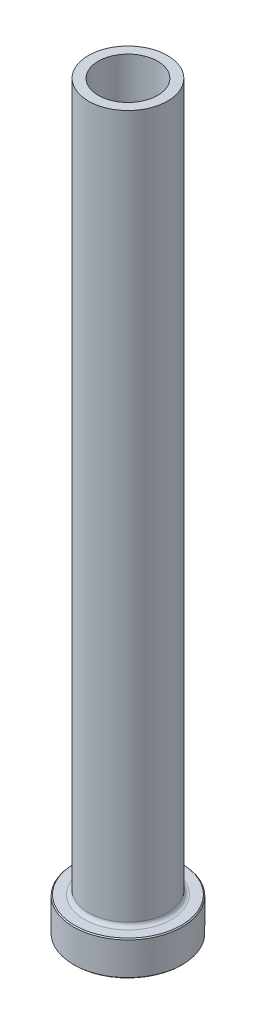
from build123d import *

# Parameters (mm, degrees)
FILLET1_R     = 0.8
CHAMFER1_SIZE = 0.2
CHAMFER3_SIZE = 0.5


with BuildPart() as part:
    # Sketch1 → Revolve1 (revolve)
    with BuildSketch(Plane.XY, mode=Mode.PRIVATE) as revolve1_sk:
        Polygon((-6, 150), (-8, 150), (-8, 7), (-11, 7), (-11, 0), (-6.25, 0), (-6.25, 83), (-6, 95), align=None)
    revolve(revolve1_sk.sketch.rotate(Axis((0, 92.187680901, 0), (0, -1, 0)), 270), axis=Axis((0, 92.187680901, 0), (0, -1, 0)))

    # Fillet1
    fillet1_edges = [part.edges().sort_by_distance(p)[0] for p in [
        (0, 7, -8),
    ]]
    fillet(fillet1_edges, radius=FILLET1_R)

    # Chamfer1
    chamfer1_edges = [part.edges().sort_by_distance(p)[0] for p in [
        (0, 0, -11),
        (0, 7, -11),
    ]]
    chamfer(chamfer1_edges, length=CHAMFER1_SIZE)

    # Chamfer3
    chamfer3_edges = [part.edges().sort_by_distance(p)[0] for p in [
        (0, 0, -6.25),
    ]]
    chamfer(chamfer3_edges, length=CHAMFER3_SIZE)


solid = part.part
